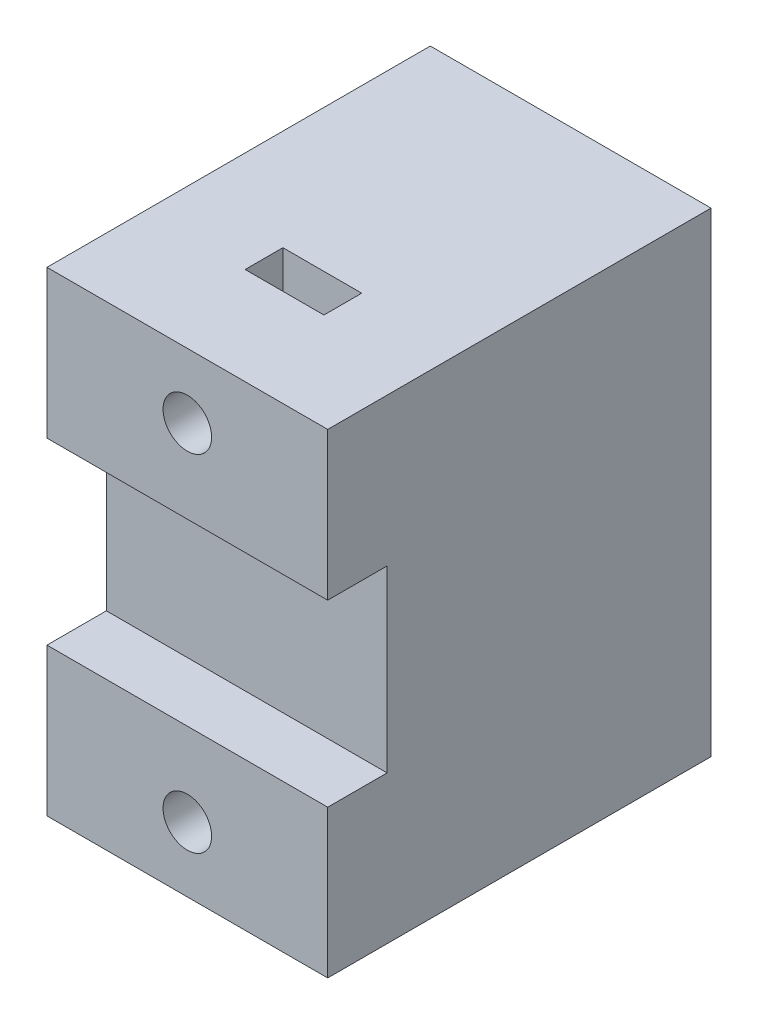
from build123d import *

# Parameters (mm, degrees)
SKETCH_1_W                                   = 26
SKETCH_1_H                                   = 44
SKETCH_1_R                                   = 2.25
RISER_BAND_1_DEPTH                           = 23
RISER_BAND_2_START                           = 23
RISER_BAND_2_DEPTH                           = 3.5
RISER_BAND_3_START                           = 26.5
SKETCH_3_W                                   = 26
SKETCH_3_H                                   = 44
SKETCH_3_R                                   = 2.25
RISER_BAND_3_DEPTH                           = 3.5
SIDE_RETENTION_LIPS_BELOW_OLD_RAIL_TOP_START = 30
SKETCH_4_W                                   = 26
SKETCH_4_H                                   = 13.7
SKETCH_4_R                                   = 2.25
SIDE_RETENTION_LIPS_BELOW_OLD_RAIL_TOP_DEPTH = 5.5


with BuildPart() as part:
    # Sketch 1 → Riser_band_1 (new body)
    with BuildSketch(Plane.XY):
        Rectangle(SKETCH_1_W, SKETCH_1_H)
        with Locations((0, -16)):
            Circle(SKETCH_1_R, mode=Mode.SUBTRACT)
        with Locations((0, 16)):
            Circle(SKETCH_1_R, mode=Mode.SUBTRACT)
    extrude(amount=RISER_BAND_1_DEPTH)

    # Sketch 2 → Riser_band_2 (add)
    with BuildSketch(Plane.XY.offset(RISER_BAND_2_START)):
        Polygon((-13, -22), (-3.65, -22), (-3.65, -11.75), (3.65, -11.75), (3.65, -22), (13, -22), (13, 22), (3.65, 22), (3.65, 11.75), (-3.65, 11.75), (-3.65, 22), (-13, 22), align=None)
    extrude(amount=RISER_BAND_2_DEPTH)

    # Sketch 3 → Riser_band_3 (add)
    with BuildSketch(Plane.XY.offset(RISER_BAND_3_START)):
        Rectangle(SKETCH_3_W, SKETCH_3_H)
        with Locations((0, -16)):
            Circle(SKETCH_3_R, mode=Mode.SUBTRACT)
        with Locations((0, 16)):
            Circle(SKETCH_3_R, mode=Mode.SUBTRACT)
    extrude(amount=RISER_BAND_3_DEPTH)

    # Sketch 4 → Side_retention_lips_below_old_rail_top (add)
    # profile 1 of 2: a face of its own
    with BuildSketch(Plane.XY.offset(SIDE_RETENTION_LIPS_BELOW_OLD_RAIL_TOP_START)):
        with Locations((0, -15.15)):
            Rectangle(SKETCH_4_W, SKETCH_4_H)
        with Locations((0, -16)):
            Circle(SKETCH_4_R, mode=Mode.SUBTRACT)
    # profile 2 of 2: a face of its own
    with BuildSketch(Plane.XY.offset(SIDE_RETENTION_LIPS_BELOW_OLD_RAIL_TOP_START)):
        with Locations((0, 15.15)):
            Rectangle(SKETCH_4_W, SKETCH_4_H)
        with Locations((0, 16)):
            Circle(SKETCH_4_R, mode=Mode.SUBTRACT)
    extrude(amount=SIDE_RETENTION_LIPS_BELOW_OLD_RAIL_TOP_DEPTH)


solid = part.part
